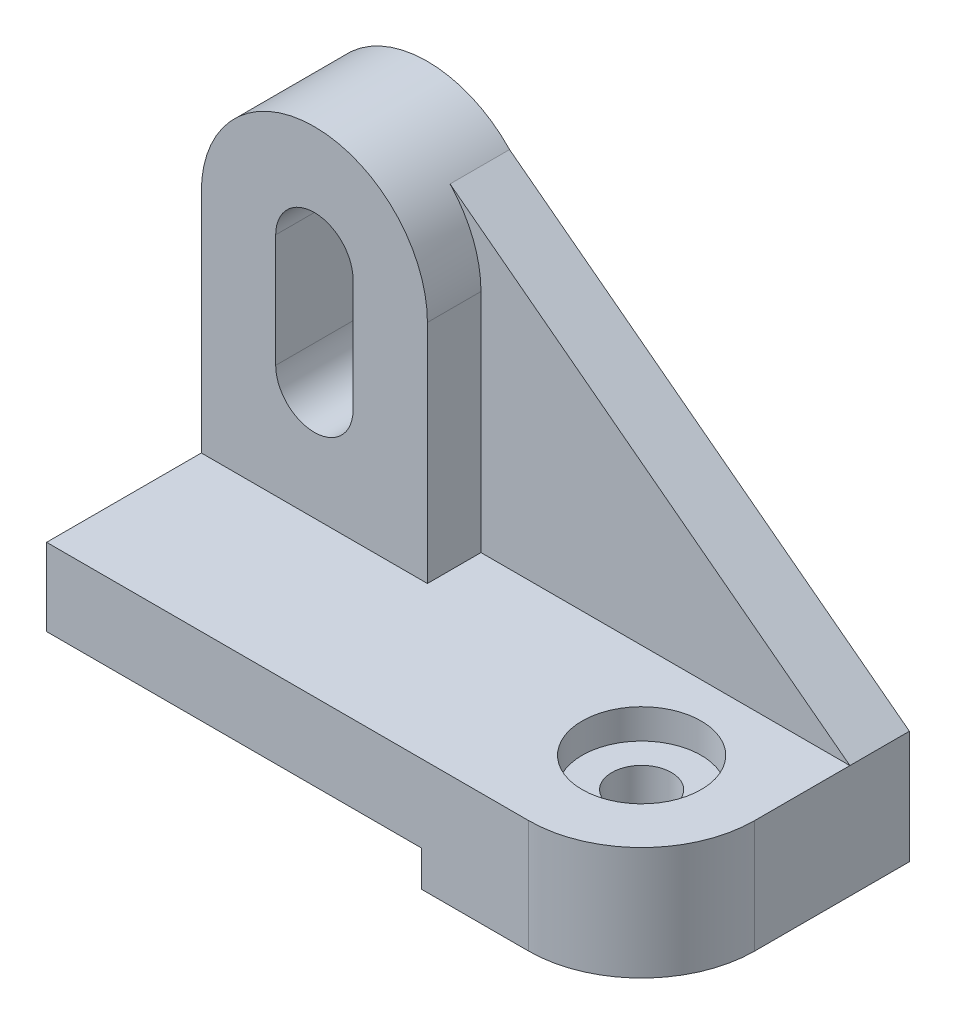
from build123d import *

# Parameters (mm, degrees)
BOSS_EXTRUDE1_DEPTH     = 450
FILLET2_R               = 190
SKETCH2_R               = 100
CUT_EXTRUDE2_DEPTH      = 50
CUT_EXTRUDE4_DEPTH      = 309
CUT_EXTRUDE4_DEPTH_BACK = 506
SKETCH6_R               = 50
BOSS_EXTRUDE2_DEPTH     = 190
RIB9_REACH              = 1302.961
SKETCH10_WALL_W         = 3447.845650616
SKETCH10_WALL_H         = 100


with BuildPart() as part:
    # Sketch1 → Boss-Extrude1 (new body)
    with BuildSketch(Plane.XY):
        Polygon((0, 0), (0, 130), (1000, 130), (1000, -60), (630, -60), (630, 0), align=None)
    extrude(amount=BOSS_EXTRUDE1_DEPTH)

    # Fillet2
    fillet2_edges = [part.edges().sort_by_distance(p)[0] for p in [
        (1000, 35, 450),
    ]]
    fillet(fillet2_edges, radius=FILLET2_R)

    # Sketch2 → Cut-Extrude2 (cut)
    with BuildSketch(Plane(origin=(0, 130, 0), x_dir=(1, 0, 0), z_dir=(0, 1, 0))):
        with Locations(Location((810, -260, 0), (0, 0, 270))):
            Circle(SKETCH2_R)
    extrude(amount=-CUT_EXTRUDE2_DEPTH, mode=Mode.SUBTRACT)

    # Sketch6 → Cut-Extrude4 (cut, two sides: drawn at the far end of the back side and taken through both)
    with BuildSketch(Plane(origin=(0, 80, 0), x_dir=(1, 0, 0), z_dir=(0, 1, 0)).offset(-CUT_EXTRUDE4_DEPTH_BACK)):
        with Locations(Location((810, -260, 0), (0, 0, 180))):
            Circle(SKETCH6_R)
    extrude(amount=CUT_EXTRUDE4_DEPTH + CUT_EXTRUDE4_DEPTH_BACK, mode=Mode.SUBTRACT)

    # Sketch8 → Boss-Extrude2 (add)
    with BuildSketch(Plane(origin=(0, 0, 0), x_dir=(-1, 0, 0), z_dir=(0, 0, -1))):
        with BuildLine():
            Line((-380, 130), (0, 130))
            Line((0, 130), (0, 510))
            ThreePointArc((0, 510), (-125.77886555, 688.817353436), (-336.58574621, 630.882666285))
            ThreePointArc((-336.58574621, 630.882666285), (-368.817353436, 574.22113445), (-380, 510))
            Line((-380, 510), (-380, 130))
        make_face()
        with BuildLine():
            ThreePointArc((-255, 510), (-190, 575), (-125, 510))
            Line((-125, 510), (-125, 320))
            ThreePointArc((-125, 320), (-190, 255), (-255, 320))
            Line((-255, 320), (-255, 510))
        make_face(mode=Mode.SUBTRACT)
    extrude(amount=-BOSS_EXTRUDE2_DEPTH)

    # Sketch10 wall → Rib9 (add, up to next)
    with BuildSketch(Plane(origin=(664.018248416, 385.280022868, 0), x_dir=(-0.796237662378, 0.604983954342, 0), z_dir=(0.604983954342, 0.796237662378, 0)), mode=Mode.PRIVATE) as rib9_sk1:
        with Locations((0, 50)):
            Rectangle(SKETCH10_WALL_W, SKETCH10_WALL_H)
    rib9_tool1 = extrude(rib9_sk1.sketch, amount=-RIB9_REACH, mode=Mode.PRIVATE) - part.part
    add(rib9_tool1.solids().sort_by_distance((664.018248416, 385.280022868, 0))[0])


solid = part.part
